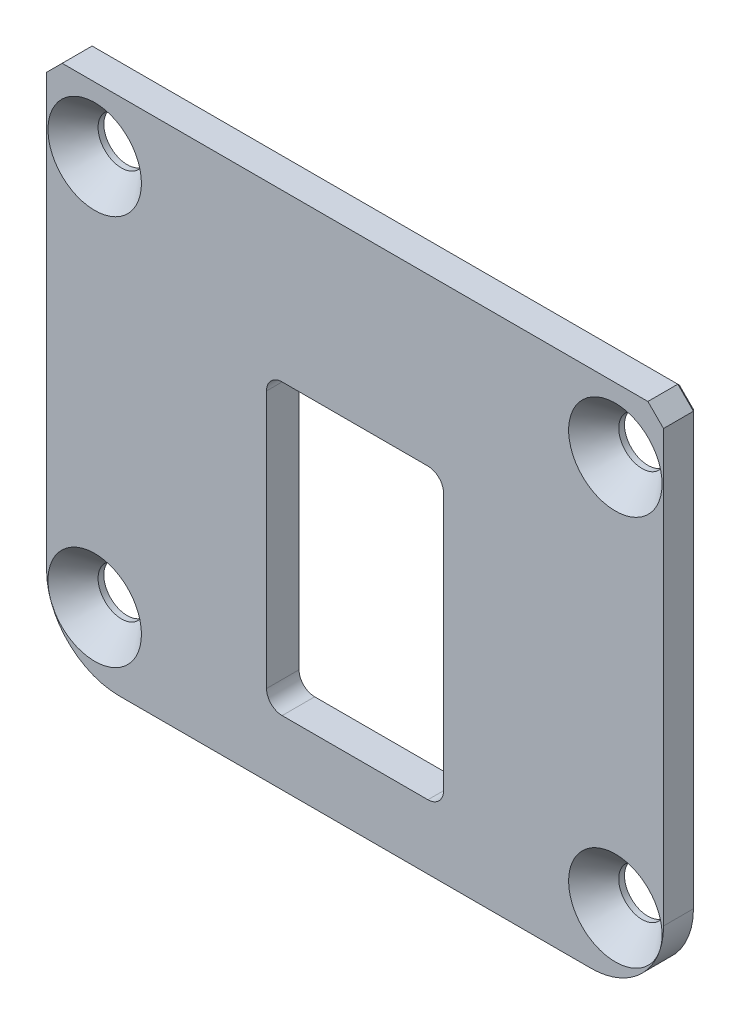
ISO-10303-21;
HEADER;
FILE_DESCRIPTION(('STEP AP214'),'2;1');
FILE_NAME('part.step','',(''),(''),'','','');
FILE_SCHEMA(('AUTOMOTIVE_DESIGN { 1 0 10303 214 1 1 1 1 }'));
ENDSEC;
DATA;
#1=APPLICATION_CONTEXT('core data for automotive mechanical design processes');
#2=APPLICATION_PROTOCOL_DEFINITION('international standard','automotive_design',2000,#1);
#3=PRODUCT_CONTEXT('',#1,'mechanical');
#4=PRODUCT('Part','Part','',(#3));
#5=PRODUCT_RELATED_PRODUCT_CATEGORY('part','',(#4));
#6=PRODUCT_DEFINITION_FORMATION('','',#4);
#7=PRODUCT_DEFINITION_CONTEXT('part definition',#1,'design');
#8=PRODUCT_DEFINITION('design','',#6,#7);
#9=PRODUCT_DEFINITION_SHAPE('','',#8);
#10=(LENGTH_UNIT() NAMED_UNIT(*) SI_UNIT(.MILLI.,.METRE.));
#11=(NAMED_UNIT(*) PLANE_ANGLE_UNIT() SI_UNIT($,.RADIAN.));
#12=(NAMED_UNIT(*) SI_UNIT($,.STERADIAN.) SOLID_ANGLE_UNIT());
#13=UNCERTAINTY_MEASURE_WITH_UNIT(LENGTH_MEASURE(1.E-05),#10,'distance_accuracy_value','');
#14=(GEOMETRIC_REPRESENTATION_CONTEXT(3) GLOBAL_UNCERTAINTY_ASSIGNED_CONTEXT((#13)) GLOBAL_UNIT_ASSIGNED_CONTEXT((#10,
#11,#12)) REPRESENTATION_CONTEXT('',''));
#15=CARTESIAN_POINT('',(0.,0.,0.));
#16=DIRECTION('',(0.,0.,1.));
#17=DIRECTION('',(1.,0.,0.));
#18=AXIS2_PLACEMENT_3D('',#15,#16,#17);
#19=CARTESIAN_POINT('',(-30.099,0.,-3.175));
#20=DIRECTION('',(-1.,0.,0.));
#21=DIRECTION('',(0.,-1.,0.));
#22=AXIS2_PLACEMENT_3D('',#19,#20,#21);
#23=PLANE('',#22);
#24=DIRECTION('',(0.,0.,-1.));
#25=VECTOR('',#24,1.);
#26=CARTESIAN_POINT('',(-30.099,-1.524,-3.175));
#27=LINE('',#26,#25);
#28=CARTESIAN_POINT('',(-30.099,-1.524,0.));
#29=VERTEX_POINT('',#28);
#30=CARTESIAN_POINT('',(-30.099,-1.524,-2.921));
#31=VERTEX_POINT('',#30);
#32=EDGE_CURVE('E296',#29,#31,#27,.T.);
#33=ORIENTED_EDGE('',*,*,#32,.T.);
#34=DIRECTION('',(0.,-1.,0.));
#35=VECTOR('',#34,1.);
#36=CARTESIAN_POINT('',(-30.099,-43.561,-2.921));
#37=LINE('',#36,#35);
#38=CARTESIAN_POINT('',(-30.099,-43.561,-2.921));
#39=VERTEX_POINT('',#38);
#40=EDGE_CURVE('E339',#31,#39,#37,.T.);
#41=ORIENTED_EDGE('',*,*,#40,.T.);
#42=DIRECTION('',(0.,0.,1.));
#43=VECTOR('',#42,1.);
#44=CARTESIAN_POINT('',(-30.099,-43.561,-3.175));
#45=LINE('',#44,#43);
#46=CARTESIAN_POINT('',(-30.099,-43.561,0.));
#47=VERTEX_POINT('',#46);
#48=EDGE_CURVE('E301',#39,#47,#45,.T.);
#49=ORIENTED_EDGE('',*,*,#48,.T.);
#50=DIRECTION('',(0.,-1.,0.));
#51=VECTOR('',#50,1.);
#52=CARTESIAN_POINT('',(-30.099,0.,0.));
#53=LINE('',#52,#51);
#54=EDGE_CURVE('E275',#29,#47,#53,.T.);
#55=ORIENTED_EDGE('',*,*,#54,.F.);
#56=EDGE_LOOP('',(#33,#41,#49,#55));
#57=FACE_BOUND('',#56,.T.);
#58=ADVANCED_FACE('F32',(#57),#23,.T.);
#59=CARTESIAN_POINT('',(-30.099,0.,-3.175));
#60=DIRECTION('',(0.,1.,0.));
#61=DIRECTION('',(0.,0.,1.));
#62=AXIS2_PLACEMENT_3D('',#59,#60,#61);
#63=PLANE('',#62);
#64=DIRECTION('',(0.,0.,-1.));
#65=VECTOR('',#64,1.);
#66=CARTESIAN_POINT('',(28.575,0.,-3.175));
#67=LINE('',#66,#65);
#68=CARTESIAN_POINT('',(28.575,0.,0.));
#69=VERTEX_POINT('',#68);
#70=CARTESIAN_POINT('',(28.575,0.,-2.921));
#71=VERTEX_POINT('',#70);
#72=EDGE_CURVE('E287',#69,#71,#67,.T.);
#73=ORIENTED_EDGE('',*,*,#72,.T.);
#74=DIRECTION('',(-1.,0.,0.));
#75=VECTOR('',#74,1.);
#76=CARTESIAN_POINT('',(-28.575,0.,-2.921));
#77=LINE('',#76,#75);
#78=CARTESIAN_POINT('',(-28.575,0.,-2.921));
#79=VERTEX_POINT('',#78);
#80=EDGE_CURVE('E335',#71,#79,#77,.T.);
#81=ORIENTED_EDGE('',*,*,#80,.T.);
#82=DIRECTION('',(0.,0.,1.));
#83=VECTOR('',#82,1.);
#84=CARTESIAN_POINT('',(-28.575,0.,-3.175));
#85=LINE('',#84,#83);
#86=CARTESIAN_POINT('',(-28.575,0.,0.));
#87=VERTEX_POINT('',#86);
#88=EDGE_CURVE('E290',#79,#87,#85,.T.);
#89=ORIENTED_EDGE('',*,*,#88,.T.);
#90=DIRECTION('',(-1.,0.,0.));
#91=VECTOR('',#90,1.);
#92=CARTESIAN_POINT('',(-30.099,0.,0.));
#93=LINE('',#92,#91);
#94=EDGE_CURVE('E284',#69,#87,#93,.T.);
#95=ORIENTED_EDGE('',*,*,#94,.F.);
#96=EDGE_LOOP('',(#73,#81,#89,#95));
#97=FACE_BOUND('',#96,.T.);
#98=ADVANCED_FACE('F429',(#97),#63,.T.);
#99=CARTESIAN_POINT('',(30.099,0.,-3.175));
#100=DIRECTION('',(1.,0.,0.));
#101=DIRECTION('',(0.,1.,0.));
#102=AXIS2_PLACEMENT_3D('',#99,#100,#101);
#103=PLANE('',#102);
#104=DIRECTION('',(0.,0.,1.));
#105=VECTOR('',#104,1.);
#106=CARTESIAN_POINT('',(30.099,-43.561,-3.175));
#107=LINE('',#106,#105);
#108=CARTESIAN_POINT('',(30.099,-43.561,0.));
#109=VERTEX_POINT('',#108);
#110=CARTESIAN_POINT('',(30.099,-43.561,-2.921));
#111=VERTEX_POINT('',#110);
#112=EDGE_CURVE('E312',#109,#111,#107,.F.);
#113=ORIENTED_EDGE('',*,*,#112,.T.);
#114=DIRECTION('',(0.,1.,0.));
#115=VECTOR('',#114,1.);
#116=CARTESIAN_POINT('',(30.099,-1.524,-2.921));
#117=LINE('',#116,#115);
#118=CARTESIAN_POINT('',(30.099,-1.524,-2.921));
#119=VERTEX_POINT('',#118);
#120=EDGE_CURVE('E341',#111,#119,#117,.T.);
#121=ORIENTED_EDGE('',*,*,#120,.T.);
#122=DIRECTION('',(0.,0.,1.));
#123=VECTOR('',#122,1.);
#124=CARTESIAN_POINT('',(30.099,-1.524,-3.175));
#125=LINE('',#124,#123);
#126=CARTESIAN_POINT('',(30.099,-1.524,0.));
#127=VERTEX_POINT('',#126);
#128=EDGE_CURVE('E299',#119,#127,#125,.T.);
#129=ORIENTED_EDGE('',*,*,#128,.T.);
#130=DIRECTION('',(0.,1.,0.));
#131=VECTOR('',#130,1.);
#132=CARTESIAN_POINT('',(30.099,0.,0.));
#133=LINE('',#132,#131);
#134=EDGE_CURVE('E281',#109,#127,#133,.T.);
#135=ORIENTED_EDGE('',*,*,#134,.F.);
#136=EDGE_LOOP('',(#113,#121,#129,#135));
#137=FACE_BOUND('',#136,.T.);
#138=ADVANCED_FACE('F420',(#137),#103,.T.);
#139=CARTESIAN_POINT('',(-30.099,-50.673,-3.175));
#140=DIRECTION('',(0.,-1.,0.));
#141=DIRECTION('',(0.,0.,-1.));
#142=AXIS2_PLACEMENT_3D('',#139,#140,#141);
#143=PLANE('',#142);
#144=DIRECTION('',(0.,0.,1.));
#145=VECTOR('',#144,1.);
#146=CARTESIAN_POINT('',(-22.987,-50.673,-3.175));
#147=LINE('',#146,#145);
#148=CARTESIAN_POINT('',(-22.987,-50.673,0.));
#149=VERTEX_POINT('',#148);
#150=CARTESIAN_POINT('',(-22.987,-50.673,-2.921));
#151=VERTEX_POINT('',#150);
#152=EDGE_CURVE('E309',#149,#151,#147,.F.);
#153=ORIENTED_EDGE('',*,*,#152,.T.);
#154=DIRECTION('',(1.,0.,0.));
#155=VECTOR('',#154,1.);
#156=CARTESIAN_POINT('',(22.987,-50.673,-2.921));
#157=LINE('',#156,#155);
#158=CARTESIAN_POINT('',(22.987,-50.673,-2.921));
#159=VERTEX_POINT('',#158);
#160=EDGE_CURVE('E11',#151,#159,#157,.T.);
#161=ORIENTED_EDGE('',*,*,#160,.T.);
#162=DIRECTION('',(0.,0.,1.));
#163=VECTOR('',#162,1.);
#164=CARTESIAN_POINT('',(22.987,-50.673,-3.175));
#165=LINE('',#164,#163);
#166=CARTESIAN_POINT('',(22.987,-50.673,0.));
#167=VERTEX_POINT('',#166);
#168=EDGE_CURVE('E307',#159,#167,#165,.T.);
#169=ORIENTED_EDGE('',*,*,#168,.T.);
#170=DIRECTION('',(1.,0.,0.));
#171=VECTOR('',#170,1.);
#172=CARTESIAN_POINT('',(-30.099,-50.673,0.));
#173=LINE('',#172,#171);
#174=EDGE_CURVE('E278',#149,#167,#173,.T.);
#175=ORIENTED_EDGE('',*,*,#174,.F.);
#176=EDGE_LOOP('',(#153,#161,#169,#175));
#177=FACE_BOUND('',#176,.T.);
#178=ADVANCED_FACE('F383',(#177),#143,.T.);
#179=CARTESIAN_POINT('',(0.,0.,-3.175));
#180=DIRECTION('',(0.,0.,1.));
#181=DIRECTION('',(1.,0.,0.));
#182=AXIS2_PLACEMENT_3D('',#179,#180,#181);
#183=PLANE('',#182);
#184=DIRECTION('',(0.,1.,0.));
#185=VECTOR('',#184,1.);
#186=CARTESIAN_POINT('',(8.636,-17.7165,-3.175));
#187=LINE('',#186,#185);
#188=CARTESIAN_POINT('',(8.636,-42.8625,-3.175));
#189=VERTEX_POINT('',#188);
#190=CARTESIAN_POINT('',(8.636,-17.7165,-3.175));
#191=VERTEX_POINT('',#190);
#192=EDGE_CURVE('E178',#189,#191,#187,.T.);
#193=ORIENTED_EDGE('',*,*,#192,.T.);
#194=CARTESIAN_POINT('',(7.112,-17.7165,-3.175));
#195=DIRECTION('',(0.,0.,1.));
#196=DIRECTION('',(-1.,0.,0.));
#197=AXIS2_PLACEMENT_3D('',#194,#195,#196);
#198=CIRCLE('',#197,1.524);
#199=CARTESIAN_POINT('',(7.112,-16.1925,-3.175));
#200=VERTEX_POINT('',#199);
#201=EDGE_CURVE('E172',#191,#200,#198,.T.);
#202=ORIENTED_EDGE('',*,*,#201,.T.);
#203=DIRECTION('',(-1.,0.,0.));
#204=VECTOR('',#203,1.);
#205=CARTESIAN_POINT('',(-7.11199999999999,-16.1925,-3.175));
#206=LINE('',#205,#204);
#207=CARTESIAN_POINT('',(-7.11199999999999,-16.1925,-3.175));
#208=VERTEX_POINT('',#207);
#209=EDGE_CURVE('E181',#200,#208,#206,.T.);
#210=ORIENTED_EDGE('',*,*,#209,.T.);
#211=CARTESIAN_POINT('',(-7.112,-17.7165,-3.175));
#212=DIRECTION('',(0.,0.,1.));
#213=DIRECTION('',(1.,0.,0.));
#214=AXIS2_PLACEMENT_3D('',#211,#212,#213);
#215=CIRCLE('',#214,1.524);
#216=CARTESIAN_POINT('',(-8.636,-17.7165,-3.175));
#217=VERTEX_POINT('',#216);
#218=EDGE_CURVE('E49',#208,#217,#215,.T.);
#219=ORIENTED_EDGE('',*,*,#218,.T.);
#220=DIRECTION('',(0.,-1.,0.));
#221=VECTOR('',#220,1.);
#222=CARTESIAN_POINT('',(-8.636,-17.7165,-3.175));
#223=LINE('',#222,#221);
#224=CARTESIAN_POINT('',(-8.63599999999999,-42.8625,-3.175));
#225=VERTEX_POINT('',#224);
#226=EDGE_CURVE('E196',#217,#225,#223,.T.);
#227=ORIENTED_EDGE('',*,*,#226,.T.);
#228=CARTESIAN_POINT('',(-7.11199999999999,-42.8625,-3.175));
#229=DIRECTION('',(0.,0.,1.));
#230=DIRECTION('',(1.,0.,0.));
#231=AXIS2_PLACEMENT_3D('',#228,#229,#230);
#232=CIRCLE('',#231,1.524);
#233=CARTESIAN_POINT('',(-7.11199999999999,-44.3865,-3.175));
#234=VERTEX_POINT('',#233);
#235=EDGE_CURVE('E199',#225,#234,#232,.T.);
#236=ORIENTED_EDGE('',*,*,#235,.T.);
#237=DIRECTION('',(1.,0.,0.));
#238=VECTOR('',#237,1.);
#239=CARTESIAN_POINT('',(-7.11199999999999,-44.3865,-3.175));
#240=LINE('',#239,#238);
#241=CARTESIAN_POINT('',(7.112,-44.3865,-3.175));
#242=VERTEX_POINT('',#241);
#243=EDGE_CURVE('E202',#234,#242,#240,.T.);
#244=ORIENTED_EDGE('',*,*,#243,.T.);
#245=CARTESIAN_POINT('',(7.112,-42.8625,-3.175));
#246=DIRECTION('',(0.,0.,1.));
#247=DIRECTION('',(1.,0.,0.));
#248=AXIS2_PLACEMENT_3D('',#245,#246,#247);
#249=CIRCLE('',#248,1.524);
#250=EDGE_CURVE('E205',#242,#189,#249,.T.);
#251=ORIENTED_EDGE('',*,*,#250,.T.);
#252=EDGE_LOOP('',(#193,#202,#210,#219,#227,#236,#244,#251));
#253=FACE_BOUND('',#252,.T.);
#254=DIRECTION('',(1.,0.,0.));
#255=VECTOR('',#254,1.);
#256=CARTESIAN_POINT('',(28.575,-0.253999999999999,-3.175));
#257=LINE('',#256,#255);
#258=CARTESIAN_POINT('',(-28.4697897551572,-0.253999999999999,-3.175));
#259=VERTEX_POINT('',#258);
#260=CARTESIAN_POINT('',(28.4697897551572,-0.253999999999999,-3.175));
#261=VERTEX_POINT('',#260);
#262=EDGE_CURVE('E327',#259,#261,#257,.T.);
#263=ORIENTED_EDGE('',*,*,#262,.T.);
#264=DIRECTION('',(0.707106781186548,-0.707106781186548,0.));
#265=VECTOR('',#264,1.);
#266=CARTESIAN_POINT('',(29.9193948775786,-1.70360512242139,-3.175));
#267=LINE('',#266,#265);
#268=CARTESIAN_POINT('',(29.845,-1.62921024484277,-3.175));
#269=VERTEX_POINT('',#268);
#270=EDGE_CURVE('E329',#261,#269,#267,.T.);
#271=ORIENTED_EDGE('',*,*,#270,.T.);
#272=DIRECTION('',(0.,-1.,0.));
#273=VECTOR('',#272,1.);
#274=CARTESIAN_POINT('',(29.845,-43.561,-3.175));
#275=LINE('',#274,#273);
#276=CARTESIAN_POINT('',(29.845,-43.561,-3.175));
#277=VERTEX_POINT('',#276);
#278=EDGE_CURVE('E321',#269,#277,#275,.T.);
#279=ORIENTED_EDGE('',*,*,#278,.T.);
#280=CARTESIAN_POINT('',(22.987,-43.561,-3.175));
#281=DIRECTION('',(0.,0.,1.));
#282=DIRECTION('',(1.,0.,0.));
#283=AXIS2_PLACEMENT_3D('',#280,#281,#282);
#284=CIRCLE('',#283,6.858);
#285=CARTESIAN_POINT('',(22.987,-50.419,-3.175));
#286=VERTEX_POINT('',#285);
#287=EDGE_CURVE('E317',#277,#286,#284,.F.);
#288=ORIENTED_EDGE('',*,*,#287,.T.);
#289=DIRECTION('',(-1.,0.,0.));
#290=VECTOR('',#289,1.);
#291=CARTESIAN_POINT('',(-22.987,-50.419,-3.175));
#292=LINE('',#291,#290);
#293=CARTESIAN_POINT('',(-22.987,-50.419,-3.175));
#294=VERTEX_POINT('',#293);
#295=EDGE_CURVE('E315',#286,#294,#292,.T.);
#296=ORIENTED_EDGE('',*,*,#295,.T.);
#297=CARTESIAN_POINT('',(-22.987,-43.561,-3.175));
#298=DIRECTION('',(0.,0.,1.));
#299=DIRECTION('',(1.,0.,0.));
#300=AXIS2_PLACEMENT_3D('',#297,#298,#299);
#301=CIRCLE('',#300,6.858);
#302=CARTESIAN_POINT('',(-29.845,-43.561,-3.175));
#303=VERTEX_POINT('',#302);
#304=EDGE_CURVE('E319',#294,#303,#301,.F.);
#305=ORIENTED_EDGE('',*,*,#304,.T.);
#306=DIRECTION('',(0.,1.,0.));
#307=VECTOR('',#306,1.);
#308=CARTESIAN_POINT('',(-29.845,-1.524,-3.175));
#309=LINE('',#308,#307);
#310=CARTESIAN_POINT('',(-29.845,-1.62921024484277,-3.175));
#311=VERTEX_POINT('',#310);
#312=EDGE_CURVE('E323',#303,#311,#309,.T.);
#313=ORIENTED_EDGE('',*,*,#312,.T.);
#314=DIRECTION('',(0.707106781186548,0.707106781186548,0.));
#315=VECTOR('',#314,1.);
#316=CARTESIAN_POINT('',(-28.3953948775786,-0.179605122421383,-3.175));
#317=LINE('',#316,#315);
#318=EDGE_CURVE('E325',#311,#259,#317,.T.);
#319=ORIENTED_EDGE('',*,*,#318,.T.);
#320=EDGE_LOOP('',(#263,#271,#279,#288,#296,#305,#313,#319));
#321=FACE_BOUND('',#320,.T.);
#322=CARTESIAN_POINT('',(-25.4,-6.2865,-3.175));
#323=DIRECTION('',(0.,0.,1.));
#324=DIRECTION('',(1.,0.,0.));
#325=AXIS2_PLACEMENT_3D('',#322,#323,#324);
#326=CIRCLE('',#325,2.286);
#327=CARTESIAN_POINT('',(-23.114,-6.2865,-3.175));
#328=VERTEX_POINT('',#327);
#329=EDGE_CURVE('E245',#328,#328,#326,.T.);
#330=ORIENTED_EDGE('',*,*,#329,.T.);
#331=EDGE_LOOP('',(#330));
#332=FACE_BOUND('',#331,.T.);
#333=CARTESIAN_POINT('',(-25.4,-44.3865,-3.175));
#334=DIRECTION('',(0.,0.,1.));
#335=DIRECTION('',(1.,0.,0.));
#336=AXIS2_PLACEMENT_3D('',#333,#334,#335);
#337=CIRCLE('',#336,2.286);
#338=CARTESIAN_POINT('',(-23.114,-44.3865,-3.175));
#339=VERTEX_POINT('',#338);
#340=EDGE_CURVE('E254',#339,#339,#337,.T.);
#341=ORIENTED_EDGE('',*,*,#340,.T.);
#342=EDGE_LOOP('',(#341));
#343=FACE_BOUND('',#342,.T.);
#344=CARTESIAN_POINT('',(25.4,-44.3865,-3.175));
#345=DIRECTION('',(0.,0.,1.));
#346=DIRECTION('',(1.,0.,0.));
#347=AXIS2_PLACEMENT_3D('',#344,#345,#346);
#348=CIRCLE('',#347,2.286);
#349=CARTESIAN_POINT('',(27.686,-44.3865,-3.175));
#350=VERTEX_POINT('',#349);
#351=EDGE_CURVE('E263',#350,#350,#348,.T.);
#352=ORIENTED_EDGE('',*,*,#351,.T.);
#353=EDGE_LOOP('',(#352));
#354=FACE_BOUND('',#353,.T.);
#355=CARTESIAN_POINT('',(25.4,-6.2865,-3.175));
#356=DIRECTION('',(0.,0.,1.));
#357=DIRECTION('',(1.,0.,0.));
#358=AXIS2_PLACEMENT_3D('',#355,#356,#357);
#359=CIRCLE('',#358,2.286);
#360=CARTESIAN_POINT('',(27.686,-6.2865,-3.175));
#361=VERTEX_POINT('',#360);
#362=EDGE_CURVE('E272',#361,#361,#359,.T.);
#363=ORIENTED_EDGE('',*,*,#362,.T.);
#364=EDGE_LOOP('',(#363));
#365=FACE_BOUND('',#364,.T.);
#366=ADVANCED_FACE('F185',(#253,#321,#332,#343,#354,#365),#183,.F.);
#367=CARTESIAN_POINT('',(0.,0.,0.));
#368=DIRECTION('',(0.,0.,1.));
#369=DIRECTION('',(1.,0.,0.));
#370=AXIS2_PLACEMENT_3D('',#367,#368,#369);
#371=PLANE('',#370);
#372=CARTESIAN_POINT('',(7.112,-17.7165,0.));
#373=DIRECTION('',(0.,0.,1.));
#374=DIRECTION('',(-1.,0.,0.));
#375=AXIS2_PLACEMENT_3D('',#372,#373,#374);
#376=CIRCLE('',#375,1.524);
#377=CARTESIAN_POINT('',(8.636,-17.7165,0.));
#378=VERTEX_POINT('',#377);
#379=CARTESIAN_POINT('',(7.112,-16.1925,0.));
#380=VERTEX_POINT('',#379);
#381=EDGE_CURVE('E57',#378,#380,#376,.T.);
#382=ORIENTED_EDGE('',*,*,#381,.F.);
#383=DIRECTION('',(0.,1.,0.));
#384=VECTOR('',#383,1.);
#385=CARTESIAN_POINT('',(8.636,-17.7165,0.));
#386=LINE('',#385,#384);
#387=CARTESIAN_POINT('',(8.636,-42.8625,0.));
#388=VERTEX_POINT('',#387);
#389=EDGE_CURVE('E189',#388,#378,#386,.T.);
#390=ORIENTED_EDGE('',*,*,#389,.F.);
#391=CARTESIAN_POINT('',(7.112,-42.8625,0.));
#392=DIRECTION('',(0.,0.,1.));
#393=DIRECTION('',(1.,0.,0.));
#394=AXIS2_PLACEMENT_3D('',#391,#392,#393);
#395=CIRCLE('',#394,1.524);
#396=CARTESIAN_POINT('',(7.112,-44.3865,0.));
#397=VERTEX_POINT('',#396);
#398=EDGE_CURVE('E192',#397,#388,#395,.T.);
#399=ORIENTED_EDGE('',*,*,#398,.F.);
#400=DIRECTION('',(1.,0.,0.));
#401=VECTOR('',#400,1.);
#402=CARTESIAN_POINT('',(-7.11199999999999,-44.3865,0.));
#403=LINE('',#402,#401);
#404=CARTESIAN_POINT('',(-7.11199999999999,-44.3865,0.));
#405=VERTEX_POINT('',#404);
#406=EDGE_CURVE('E220',#405,#397,#403,.T.);
#407=ORIENTED_EDGE('',*,*,#406,.F.);
#408=CARTESIAN_POINT('',(-7.11199999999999,-42.8625,0.));
#409=DIRECTION('',(0.,0.,1.));
#410=DIRECTION('',(1.,0.,0.));
#411=AXIS2_PLACEMENT_3D('',#408,#409,#410);
#412=CIRCLE('',#411,1.524);
#413=CARTESIAN_POINT('',(-8.63599999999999,-42.8625,0.));
#414=VERTEX_POINT('',#413);
#415=EDGE_CURVE('E217',#414,#405,#412,.T.);
#416=ORIENTED_EDGE('',*,*,#415,.F.);
#417=DIRECTION('',(0.,-1.,0.));
#418=VECTOR('',#417,1.);
#419=CARTESIAN_POINT('',(-8.636,-17.7165,0.));
#420=LINE('',#419,#418);
#421=CARTESIAN_POINT('',(-8.636,-17.7165,0.));
#422=VERTEX_POINT('',#421);
#423=EDGE_CURVE('E214',#422,#414,#420,.T.);
#424=ORIENTED_EDGE('',*,*,#423,.F.);
#425=CARTESIAN_POINT('',(-7.112,-17.7165,0.));
#426=DIRECTION('',(0.,0.,1.));
#427=DIRECTION('',(1.,0.,0.));
#428=AXIS2_PLACEMENT_3D('',#425,#426,#427);
#429=CIRCLE('',#428,1.524);
#430=CARTESIAN_POINT('',(-7.11199999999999,-16.1925,0.));
#431=VERTEX_POINT('',#430);
#432=EDGE_CURVE('E211',#431,#422,#429,.T.);
#433=ORIENTED_EDGE('',*,*,#432,.F.);
#434=DIRECTION('',(-1.,0.,0.));
#435=VECTOR('',#434,1.);
#436=CARTESIAN_POINT('',(-7.11199999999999,-16.1925,0.));
#437=LINE('',#436,#435);
#438=EDGE_CURVE('E209',#380,#431,#437,.T.);
#439=ORIENTED_EDGE('',*,*,#438,.F.);
#440=EDGE_LOOP('',(#382,#390,#399,#407,#416,#424,#433,#439));
#441=FACE_BOUND('',#440,.T.);
#442=CARTESIAN_POINT('',(-25.4,-6.2865,0.));
#443=DIRECTION('',(0.,0.,1.));
#444=DIRECTION('',(1.,0.,0.));
#445=AXIS2_PLACEMENT_3D('',#442,#443,#444);
#446=CIRCLE('',#445,4.5593);
#447=CARTESIAN_POINT('',(-20.8407,-6.2865,0.));
#448=VERTEX_POINT('',#447);
#449=EDGE_CURVE('E239',#448,#448,#446,.T.);
#450=ORIENTED_EDGE('',*,*,#449,.F.);
#451=EDGE_LOOP('',(#450));
#452=FACE_BOUND('',#451,.T.);
#453=CARTESIAN_POINT('',(-25.4,-44.3865,0.));
#454=DIRECTION('',(0.,0.,1.));
#455=DIRECTION('',(1.,0.,0.));
#456=AXIS2_PLACEMENT_3D('',#453,#454,#455);
#457=CIRCLE('',#456,4.5593);
#458=CARTESIAN_POINT('',(-20.8407,-44.3865,0.));
#459=VERTEX_POINT('',#458);
#460=EDGE_CURVE('E248',#459,#459,#457,.T.);
#461=ORIENTED_EDGE('',*,*,#460,.F.);
#462=EDGE_LOOP('',(#461));
#463=FACE_BOUND('',#462,.T.);
#464=CARTESIAN_POINT('',(25.4,-44.3865,0.));
#465=DIRECTION('',(0.,0.,1.));
#466=DIRECTION('',(1.,0.,0.));
#467=AXIS2_PLACEMENT_3D('',#464,#465,#466);
#468=CIRCLE('',#467,4.5593);
#469=CARTESIAN_POINT('',(29.9593,-44.3865,0.));
#470=VERTEX_POINT('',#469);
#471=EDGE_CURVE('E257',#470,#470,#468,.T.);
#472=ORIENTED_EDGE('',*,*,#471,.F.);
#473=EDGE_LOOP('',(#472));
#474=FACE_BOUND('',#473,.T.);
#475=CARTESIAN_POINT('',(25.4,-6.2865,0.));
#476=DIRECTION('',(0.,0.,1.));
#477=DIRECTION('',(1.,0.,0.));
#478=AXIS2_PLACEMENT_3D('',#475,#476,#477);
#479=CIRCLE('',#478,4.5593);
#480=CARTESIAN_POINT('',(29.9593,-6.2865,0.));
#481=VERTEX_POINT('',#480);
#482=EDGE_CURVE('E266',#481,#481,#479,.T.);
#483=ORIENTED_EDGE('',*,*,#482,.F.);
#484=EDGE_LOOP('',(#483));
#485=FACE_BOUND('',#484,.T.);
#486=ORIENTED_EDGE('',*,*,#54,.T.);
#487=CARTESIAN_POINT('',(-22.987,-43.561,0.));
#488=DIRECTION('',(0.,0.,1.));
#489=DIRECTION('',(1.,0.,0.));
#490=AXIS2_PLACEMENT_3D('',#487,#488,#489);
#491=CIRCLE('',#490,7.112);
#492=EDGE_CURVE('E305',#47,#149,#491,.T.);
#493=ORIENTED_EDGE('',*,*,#492,.T.);
#494=ORIENTED_EDGE('',*,*,#174,.T.);
#495=CARTESIAN_POINT('',(22.987,-43.561,0.));
#496=DIRECTION('',(0.,0.,1.));
#497=DIRECTION('',(1.,0.,0.));
#498=AXIS2_PLACEMENT_3D('',#495,#496,#497);
#499=CIRCLE('',#498,7.112);
#500=EDGE_CURVE('E303',#167,#109,#499,.T.);
#501=ORIENTED_EDGE('',*,*,#500,.T.);
#502=ORIENTED_EDGE('',*,*,#134,.T.);
#503=DIRECTION('',(0.707106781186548,-0.707106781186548,0.));
#504=VECTOR('',#503,1.);
#505=CARTESIAN_POINT('',(14.2875,14.2875,0.));
#506=LINE('',#505,#504);
#507=EDGE_CURVE('E292',#127,#69,#506,.F.);
#508=ORIENTED_EDGE('',*,*,#507,.T.);
#509=ORIENTED_EDGE('',*,*,#94,.T.);
#510=DIRECTION('',(0.707106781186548,0.707106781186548,0.));
#511=VECTOR('',#510,1.);
#512=CARTESIAN_POINT('',(-14.2875,14.2875,0.));
#513=LINE('',#512,#511);
#514=EDGE_CURVE('E294',#87,#29,#513,.F.);
#515=ORIENTED_EDGE('',*,*,#514,.T.);
#516=EDGE_LOOP('',(#486,#493,#494,#501,#502,#508,#509,#515));
#517=FACE_BOUND('',#516,.T.);
#518=ADVANCED_FACE('F387',(#441,#452,#463,#474,#485,#517),#371,.T.);
#519=CARTESIAN_POINT('',(-28.575,0.,-3.175));
#520=DIRECTION('',(0.707106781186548,-0.707106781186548,0.));
#521=DIRECTION('',(0.,0.,1.));
#522=AXIS2_PLACEMENT_3D('',#519,#520,#521);
#523=PLANE('',#522);
#524=ORIENTED_EDGE('',*,*,#88,.F.);
#525=DIRECTION('',(0.707106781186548,0.707106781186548,0.));
#526=VECTOR('',#525,1.);
#527=CARTESIAN_POINT('',(-30.099,-1.524,-2.921));
#528=LINE('',#527,#526);
#529=EDGE_CURVE('E337',#79,#31,#528,.F.);
#530=ORIENTED_EDGE('',*,*,#529,.T.);
#531=ORIENTED_EDGE('',*,*,#32,.F.);
#532=ORIENTED_EDGE('',*,*,#514,.F.);
#533=EDGE_LOOP('',(#524,#530,#531,#532));
#534=FACE_BOUND('',#533,.T.);
#535=ADVANCED_FACE('F395',(#534),#523,.F.);
#536=CARTESIAN_POINT('',(30.099,-1.524,-3.175));
#537=DIRECTION('',(-0.707106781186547,-0.707106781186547,0.));
#538=DIRECTION('',(0.,0.,1.));
#539=AXIS2_PLACEMENT_3D('',#536,#537,#538);
#540=PLANE('',#539);
#541=ORIENTED_EDGE('',*,*,#128,.F.);
#542=DIRECTION('',(0.707106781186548,-0.707106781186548,0.));
#543=VECTOR('',#542,1.);
#544=CARTESIAN_POINT('',(28.575,0.,-2.921));
#545=LINE('',#544,#543);
#546=EDGE_CURVE('E332',#119,#71,#545,.F.);
#547=ORIENTED_EDGE('',*,*,#546,.T.);
#548=ORIENTED_EDGE('',*,*,#72,.F.);
#549=ORIENTED_EDGE('',*,*,#507,.F.);
#550=EDGE_LOOP('',(#541,#547,#548,#549));
#551=FACE_BOUND('',#550,.T.);
#552=ADVANCED_FACE('F426',(#551),#540,.F.);
#553=CARTESIAN_POINT('',(-22.987,-43.561,-3.175));
#554=DIRECTION('',(0.,0.,1.));
#555=DIRECTION('',(1.,0.,0.));
#556=AXIS2_PLACEMENT_3D('',#553,#554,#555);
#557=CYLINDRICAL_SURFACE('',#556,7.112);
#558=ORIENTED_EDGE('',*,*,#48,.F.);
#559=CARTESIAN_POINT('',(-22.987,-43.561,-2.921));
#560=DIRECTION('',(0.,0.,1.));
#561=DIRECTION('',(1.,0.,0.));
#562=AXIS2_PLACEMENT_3D('',#559,#560,#561);
#563=CIRCLE('',#562,7.112);
#564=EDGE_CURVE('E343',#39,#151,#563,.T.);
#565=ORIENTED_EDGE('',*,*,#564,.T.);
#566=ORIENTED_EDGE('',*,*,#152,.F.);
#567=ORIENTED_EDGE('',*,*,#492,.F.);
#568=EDGE_LOOP('',(#558,#565,#566,#567));
#569=FACE_BOUND('',#568,.T.);
#570=ADVANCED_FACE('F379',(#569),#557,.T.);
#571=CARTESIAN_POINT('',(22.987,-43.561,-3.175));
#572=DIRECTION('',(0.,0.,1.));
#573=DIRECTION('',(1.,0.,0.));
#574=AXIS2_PLACEMENT_3D('',#571,#572,#573);
#575=CYLINDRICAL_SURFACE('',#574,7.112);
#576=ORIENTED_EDGE('',*,*,#168,.F.);
#577=CARTESIAN_POINT('',(22.987,-43.561,-2.921));
#578=DIRECTION('',(0.,0.,1.));
#579=DIRECTION('',(1.,0.,0.));
#580=AXIS2_PLACEMENT_3D('',#577,#578,#579);
#581=CIRCLE('',#580,7.112);
#582=EDGE_CURVE('E41',#159,#111,#581,.T.);
#583=ORIENTED_EDGE('',*,*,#582,.T.);
#584=ORIENTED_EDGE('',*,*,#112,.F.);
#585=ORIENTED_EDGE('',*,*,#500,.F.);
#586=EDGE_LOOP('',(#576,#583,#584,#585));
#587=FACE_BOUND('',#586,.T.);
#588=ADVANCED_FACE('F418',(#587),#575,.T.);
#589=CARTESIAN_POINT('',(25.4,-6.2865,0.));
#590=DIRECTION('',(0.,0.,1.));
#591=DIRECTION('',(1.,0.,0.));
#592=AXIS2_PLACEMENT_3D('',#589,#590,#591);
#593=CYLINDRICAL_SURFACE('',#592,2.286);
#594=ORIENTED_EDGE('',*,*,#362,.F.);
#595=EDGE_LOOP('',(#594));
#596=FACE_BOUND('',#595,.T.);
#597=CARTESIAN_POINT('',(25.4,-6.2865,-2.61513250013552));
#598=DIRECTION('',(0.,0.,1.));
#599=DIRECTION('',(1.,0.,0.));
#600=AXIS2_PLACEMENT_3D('',#597,#598,#599);
#601=CIRCLE('',#600,2.286);
#602=CARTESIAN_POINT('',(27.686,-6.2865,-2.61513250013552));
#603=VERTEX_POINT('',#602);
#604=EDGE_CURVE('E269',#603,#603,#601,.T.);
#605=ORIENTED_EDGE('',*,*,#604,.T.);
#606=EDGE_LOOP('',(#605));
#607=FACE_BOUND('',#606,.T.);
#608=ADVANCED_FACE('F451',(#596,#607),#593,.F.);
#609=CARTESIAN_POINT('',(25.4,-6.2865,0.));
#610=DIRECTION('',(0.,0.,1.));
#611=DIRECTION('',(1.,0.,0.));
#612=AXIS2_PLACEMENT_3D('',#609,#610,#611);
#613=CONICAL_SURFACE('',#612,4.5593,0.715584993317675);
#614=ORIENTED_EDGE('',*,*,#604,.F.);
#615=EDGE_LOOP('',(#614));
#616=FACE_BOUND('',#615,.T.);
#617=ORIENTED_EDGE('',*,*,#482,.T.);
#618=EDGE_LOOP('',(#617));
#619=FACE_BOUND('',#618,.T.);
#620=ADVANCED_FACE('F503',(#616,#619),#613,.F.);
#621=CARTESIAN_POINT('',(25.4,-44.3865,0.));
#622=DIRECTION('',(0.,0.,1.));
#623=DIRECTION('',(1.,0.,0.));
#624=AXIS2_PLACEMENT_3D('',#621,#622,#623);
#625=CYLINDRICAL_SURFACE('',#624,2.286);
#626=ORIENTED_EDGE('',*,*,#351,.F.);
#627=EDGE_LOOP('',(#626));
#628=FACE_BOUND('',#627,.T.);
#629=CARTESIAN_POINT('',(25.4,-44.3865,-2.61513250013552));
#630=DIRECTION('',(0.,0.,1.));
#631=DIRECTION('',(1.,0.,0.));
#632=AXIS2_PLACEMENT_3D('',#629,#630,#631);
#633=CIRCLE('',#632,2.286);
#634=CARTESIAN_POINT('',(27.686,-44.3865,-2.61513250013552));
#635=VERTEX_POINT('',#634);
#636=EDGE_CURVE('E260',#635,#635,#633,.T.);
#637=ORIENTED_EDGE('',*,*,#636,.T.);
#638=EDGE_LOOP('',(#637));
#639=FACE_BOUND('',#638,.T.);
#640=ADVANCED_FACE('F499',(#628,#639),#625,.F.);
#641=CARTESIAN_POINT('',(25.4,-44.3865,0.));
#642=DIRECTION('',(0.,0.,1.));
#643=DIRECTION('',(1.,0.,0.));
#644=AXIS2_PLACEMENT_3D('',#641,#642,#643);
#645=CONICAL_SURFACE('',#644,4.5593,0.715584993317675);
#646=ORIENTED_EDGE('',*,*,#636,.F.);
#647=EDGE_LOOP('',(#646));
#648=FACE_BOUND('',#647,.T.);
#649=ORIENTED_EDGE('',*,*,#471,.T.);
#650=EDGE_LOOP('',(#649));
#651=FACE_BOUND('',#650,.T.);
#652=ADVANCED_FACE('F495',(#648,#651),#645,.F.);
#653=CARTESIAN_POINT('',(-25.4,-44.3865,0.));
#654=DIRECTION('',(0.,0.,1.));
#655=DIRECTION('',(1.,0.,0.));
#656=AXIS2_PLACEMENT_3D('',#653,#654,#655);
#657=CYLINDRICAL_SURFACE('',#656,2.286);
#658=ORIENTED_EDGE('',*,*,#340,.F.);
#659=EDGE_LOOP('',(#658));
#660=FACE_BOUND('',#659,.T.);
#661=CARTESIAN_POINT('',(-25.4,-44.3865,-2.61513250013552));
#662=DIRECTION('',(0.,0.,1.));
#663=DIRECTION('',(1.,0.,0.));
#664=AXIS2_PLACEMENT_3D('',#661,#662,#663);
#665=CIRCLE('',#664,2.286);
#666=CARTESIAN_POINT('',(-23.114,-44.3865,-2.61513250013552));
#667=VERTEX_POINT('',#666);
#668=EDGE_CURVE('E251',#667,#667,#665,.T.);
#669=ORIENTED_EDGE('',*,*,#668,.T.);
#670=EDGE_LOOP('',(#669));
#671=FACE_BOUND('',#670,.T.);
#672=ADVANCED_FACE('F491',(#660,#671),#657,.F.);
#673=CARTESIAN_POINT('',(-25.4,-44.3865,0.));
#674=DIRECTION('',(0.,0.,1.));
#675=DIRECTION('',(1.,0.,0.));
#676=AXIS2_PLACEMENT_3D('',#673,#674,#675);
#677=CONICAL_SURFACE('',#676,4.5593,0.715584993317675);
#678=ORIENTED_EDGE('',*,*,#668,.F.);
#679=EDGE_LOOP('',(#678));
#680=FACE_BOUND('',#679,.T.);
#681=ORIENTED_EDGE('',*,*,#460,.T.);
#682=EDGE_LOOP('',(#681));
#683=FACE_BOUND('',#682,.T.);
#684=ADVANCED_FACE('F481',(#680,#683),#677,.F.);
#685=CARTESIAN_POINT('',(-25.4,-6.2865,0.));
#686=DIRECTION('',(0.,0.,1.));
#687=DIRECTION('',(1.,0.,0.));
#688=AXIS2_PLACEMENT_3D('',#685,#686,#687);
#689=CYLINDRICAL_SURFACE('',#688,2.286);
#690=ORIENTED_EDGE('',*,*,#329,.F.);
#691=EDGE_LOOP('',(#690));
#692=FACE_BOUND('',#691,.T.);
#693=CARTESIAN_POINT('',(-25.4,-6.2865,-2.61513250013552));
#694=DIRECTION('',(0.,0.,1.));
#695=DIRECTION('',(1.,0.,0.));
#696=AXIS2_PLACEMENT_3D('',#693,#694,#695);
#697=CIRCLE('',#696,2.286);
#698=CARTESIAN_POINT('',(-23.114,-6.2865,-2.61513250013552));
#699=VERTEX_POINT('',#698);
#700=EDGE_CURVE('E242',#699,#699,#697,.T.);
#701=ORIENTED_EDGE('',*,*,#700,.T.);
#702=EDGE_LOOP('',(#701));
#703=FACE_BOUND('',#702,.T.);
#704=ADVANCED_FACE('F475',(#692,#703),#689,.F.);
#705=CARTESIAN_POINT('',(-25.4,-6.2865,0.));
#706=DIRECTION('',(0.,0.,1.));
#707=DIRECTION('',(1.,0.,0.));
#708=AXIS2_PLACEMENT_3D('',#705,#706,#707);
#709=CONICAL_SURFACE('',#708,4.5593,0.715584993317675);
#710=ORIENTED_EDGE('',*,*,#700,.F.);
#711=EDGE_LOOP('',(#710));
#712=FACE_BOUND('',#711,.T.);
#713=ORIENTED_EDGE('',*,*,#449,.T.);
#714=EDGE_LOOP('',(#713));
#715=FACE_BOUND('',#714,.T.);
#716=ADVANCED_FACE('F471',(#712,#715),#709,.F.);
#717=CARTESIAN_POINT('',(-22.987,-43.561,-3.175));
#718=DIRECTION('',(0.,0.,1.));
#719=DIRECTION('',(1.,0.,0.));
#720=AXIS2_PLACEMENT_3D('',#717,#718,#719);
#721=CONICAL_SURFACE('',#720,6.858,0.785398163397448);
#722=DIRECTION('',(0.,0.707106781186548,-0.707106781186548));
#723=VECTOR('',#722,1.);
#724=CARTESIAN_POINT('',(-22.987,-50.673,-2.921));
#725=LINE('',#724,#723);
#726=EDGE_CURVE('E360',#151,#294,#725,.T.);
#727=ORIENTED_EDGE('',*,*,#726,.F.);
#728=ORIENTED_EDGE('',*,*,#564,.F.);
#729=DIRECTION('',(-0.707106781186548,0.,0.707106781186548));
#730=VECTOR('',#729,1.);
#731=CARTESIAN_POINT('',(-29.845,-43.561,-3.175));
#732=LINE('',#731,#730);
#733=EDGE_CURVE('E36',#303,#39,#732,.T.);
#734=ORIENTED_EDGE('',*,*,#733,.F.);
#735=ORIENTED_EDGE('',*,*,#304,.F.);
#736=EDGE_LOOP('',(#727,#728,#734,#735));
#737=FACE_BOUND('',#736,.T.);
#738=ADVANCED_FACE('F34',(#737),#721,.T.);
#739=CARTESIAN_POINT('',(-30.099,0.,-2.921));
#740=DIRECTION('',(-0.707106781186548,0.,-0.707106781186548));
#741=DIRECTION('',(0.,1.,0.));
#742=AXIS2_PLACEMENT_3D('',#739,#740,#741);
#743=PLANE('',#742);
#744=ORIENTED_EDGE('',*,*,#733,.T.);
#745=ORIENTED_EDGE('',*,*,#40,.F.);
#746=DIRECTION('',(-0.678598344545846,0.281084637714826,0.678598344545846));
#747=VECTOR('',#746,1.);
#748=CARTESIAN_POINT('',(-30.3896932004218,-1.40359093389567,-2.63030679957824));
#749=LINE('',#748,#747);
#750=EDGE_CURVE('E358',#311,#31,#749,.T.);
#751=ORIENTED_EDGE('',*,*,#750,.F.);
#752=ORIENTED_EDGE('',*,*,#312,.F.);
#753=EDGE_LOOP('',(#744,#745,#751,#752));
#754=FACE_BOUND('',#753,.T.);
#755=ADVANCED_FACE('F371',(#754),#743,.T.);
#756=CARTESIAN_POINT('',(-30.099,-50.673,-2.921));
#757=DIRECTION('',(0.,-0.707106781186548,-0.707106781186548));
#758=DIRECTION('',(-1.,0.,0.));
#759=AXIS2_PLACEMENT_3D('',#756,#757,#758);
#760=PLANE('',#759);
#761=ORIENTED_EDGE('',*,*,#726,.T.);
#762=ORIENTED_EDGE('',*,*,#295,.F.);
#763=DIRECTION('',(0.,0.707106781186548,-0.707106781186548));
#764=VECTOR('',#763,1.);
#765=CARTESIAN_POINT('',(22.987,-50.673,-2.921));
#766=LINE('',#765,#764);
#767=EDGE_CURVE('E355',#159,#286,#766,.T.);
#768=ORIENTED_EDGE('',*,*,#767,.F.);
#769=ORIENTED_EDGE('',*,*,#160,.F.);
#770=EDGE_LOOP('',(#761,#762,#768,#769));
#771=FACE_BOUND('',#770,.T.);
#772=ADVANCED_FACE('F410',(#771),#760,.T.);
#773=CARTESIAN_POINT('',(-14.1078948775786,14.1078948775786,-3.175));
#774=DIRECTION('',(0.499999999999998,-0.499999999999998,0.70710678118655));
#775=DIRECTION('',(0.707106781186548,0.707106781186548,0.));
#776=AXIS2_PLACEMENT_3D('',#773,#774,#775);
#777=PLANE('',#776);
#778=ORIENTED_EDGE('',*,*,#750,.T.);
#779=ORIENTED_EDGE('',*,*,#529,.F.);
#780=DIRECTION('',(-0.281084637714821,0.678598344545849,0.678598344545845));
#781=VECTOR('',#780,1.);
#782=CARTESIAN_POINT('',(-30.0745160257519,3.6201519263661,0.699151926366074));
#783=LINE('',#782,#781);
#784=EDGE_CURVE('E352',#259,#79,#783,.T.);
#785=ORIENTED_EDGE('',*,*,#784,.F.);
#786=ORIENTED_EDGE('',*,*,#318,.F.);
#787=EDGE_LOOP('',(#778,#779,#785,#786));
#788=FACE_BOUND('',#787,.T.);
#789=ADVANCED_FACE('F399',(#788),#777,.F.);
#790=CARTESIAN_POINT('',(22.987,-43.561,-3.175));
#791=DIRECTION('',(0.,0.,1.));
#792=DIRECTION('',(1.,0.,0.));
#793=AXIS2_PLACEMENT_3D('',#790,#791,#792);
#794=CONICAL_SURFACE('',#793,6.858,0.785398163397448);
#795=ORIENTED_EDGE('',*,*,#767,.T.);
#796=ORIENTED_EDGE('',*,*,#287,.F.);
#797=DIRECTION('',(-0.707106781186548,0.,-0.707106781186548));
#798=VECTOR('',#797,1.);
#799=CARTESIAN_POINT('',(30.099,-43.561,-2.921));
#800=LINE('',#799,#798);
#801=EDGE_CURVE('E349',#111,#277,#800,.T.);
#802=ORIENTED_EDGE('',*,*,#801,.F.);
#803=ORIENTED_EDGE('',*,*,#582,.F.);
#804=EDGE_LOOP('',(#795,#796,#802,#803));
#805=FACE_BOUND('',#804,.T.);
#806=ADVANCED_FACE('F413',(#805),#794,.T.);
#807=CARTESIAN_POINT('',(-30.099,0.,-2.921));
#808=DIRECTION('',(0.,0.707106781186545,-0.70710678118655));
#809=DIRECTION('',(1.,0.,0.));
#810=AXIS2_PLACEMENT_3D('',#807,#808,#809);
#811=PLANE('',#810);
#812=ORIENTED_EDGE('',*,*,#784,.T.);
#813=ORIENTED_EDGE('',*,*,#80,.F.);
#814=DIRECTION('',(0.281084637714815,0.67859834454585,0.678598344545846));
#815=VECTOR('',#814,1.);
#816=CARTESIAN_POINT('',(23.9392509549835,-11.1916882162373,-14.1126882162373));
#817=LINE('',#816,#815);
#818=EDGE_CURVE('E347',#261,#71,#817,.T.);
#819=ORIENTED_EDGE('',*,*,#818,.F.);
#820=ORIENTED_EDGE('',*,*,#262,.F.);
#821=EDGE_LOOP('',(#812,#813,#819,#820));
#822=FACE_BOUND('',#821,.T.);
#823=ADVANCED_FACE('F404',(#822),#811,.T.);
#824=CARTESIAN_POINT('',(30.099,0.,-2.921));
#825=DIRECTION('',(0.707106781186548,0.,-0.707106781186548));
#826=DIRECTION('',(0.,-1.,0.));
#827=AXIS2_PLACEMENT_3D('',#824,#825,#826);
#828=PLANE('',#827);
#829=ORIENTED_EDGE('',*,*,#801,.T.);
#830=ORIENTED_EDGE('',*,*,#278,.F.);
#831=DIRECTION('',(-0.678598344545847,-0.28108463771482,-0.678598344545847));
#832=VECTOR('',#831,1.);
#833=CARTESIAN_POINT('',(30.3896932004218,-1.40359093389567,-2.63030679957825));
#834=LINE('',#833,#832);
#835=EDGE_CURVE('E227',#119,#269,#834,.T.);
#836=ORIENTED_EDGE('',*,*,#835,.F.);
#837=ORIENTED_EDGE('',*,*,#120,.F.);
#838=EDGE_LOOP('',(#829,#830,#836,#837));
#839=FACE_BOUND('',#838,.T.);
#840=ADVANCED_FACE('F455',(#839),#828,.T.);
#841=CARTESIAN_POINT('',(14.1078948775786,14.1078948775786,-3.175));
#842=DIRECTION('',(-0.5,-0.5,0.707106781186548));
#843=DIRECTION('',(0.707106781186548,-0.707106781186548,0.));
#844=AXIS2_PLACEMENT_3D('',#841,#842,#843);
#845=PLANE('',#844);
#846=ORIENTED_EDGE('',*,*,#818,.T.);
#847=ORIENTED_EDGE('',*,*,#546,.F.);
#848=ORIENTED_EDGE('',*,*,#835,.T.);
#849=ORIENTED_EDGE('',*,*,#270,.F.);
#850=EDGE_LOOP('',(#846,#847,#848,#849));
#851=FACE_BOUND('',#850,.T.);
#852=ADVANCED_FACE('F452',(#851),#845,.F.);
#853=CARTESIAN_POINT('',(7.112,-17.7165,-3.175));
#854=DIRECTION('',(0.,0.,1.));
#855=DIRECTION('',(1.,0.,0.));
#856=AXIS2_PLACEMENT_3D('',#853,#854,#855);
#857=CYLINDRICAL_SURFACE('',#856,1.524);
#858=ORIENTED_EDGE('',*,*,#381,.T.);
#859=DIRECTION('',(0.,0.,1.));
#860=VECTOR('',#859,1.);
#861=CARTESIAN_POINT('',(7.112,-16.1925,-3.175));
#862=LINE('',#861,#860);
#863=EDGE_CURVE('E168',#200,#380,#862,.T.);
#864=ORIENTED_EDGE('',*,*,#863,.F.);
#865=ORIENTED_EDGE('',*,*,#201,.F.);
#866=DIRECTION('',(0.,0.,1.));
#867=VECTOR('',#866,1.);
#868=CARTESIAN_POINT('',(8.636,-17.7165,-3.175));
#869=LINE('',#868,#867);
#870=EDGE_CURVE('E225',#191,#378,#869,.T.);
#871=ORIENTED_EDGE('',*,*,#870,.T.);
#872=EDGE_LOOP('',(#858,#864,#865,#871));
#873=FACE_BOUND('',#872,.T.);
#874=ADVANCED_FACE('F170',(#873),#857,.F.);
#875=CARTESIAN_POINT('',(8.636,-17.7165,-3.175));
#876=DIRECTION('',(1.,0.,0.));
#877=DIRECTION('',(0.,1.,0.));
#878=AXIS2_PLACEMENT_3D('',#875,#876,#877);
#879=PLANE('',#878);
#880=ORIENTED_EDGE('',*,*,#389,.T.);
#881=ORIENTED_EDGE('',*,*,#870,.F.);
#882=ORIENTED_EDGE('',*,*,#192,.F.);
#883=DIRECTION('',(0.,0.,1.));
#884=VECTOR('',#883,1.);
#885=CARTESIAN_POINT('',(8.636,-42.8625,-3.175));
#886=LINE('',#885,#884);
#887=EDGE_CURVE('E228',#189,#388,#886,.T.);
#888=ORIENTED_EDGE('',*,*,#887,.T.);
#889=EDGE_LOOP('',(#880,#881,#882,#888));
#890=FACE_BOUND('',#889,.T.);
#891=ADVANCED_FACE('F548',(#890),#879,.F.);
#892=CARTESIAN_POINT('',(7.112,-42.8625,-3.175));
#893=DIRECTION('',(0.,0.,1.));
#894=DIRECTION('',(1.,0.,0.));
#895=AXIS2_PLACEMENT_3D('',#892,#893,#894);
#896=CYLINDRICAL_SURFACE('',#895,1.524);
#897=ORIENTED_EDGE('',*,*,#398,.T.);
#898=ORIENTED_EDGE('',*,*,#887,.F.);
#899=ORIENTED_EDGE('',*,*,#250,.F.);
#900=DIRECTION('',(0.,0.,1.));
#901=VECTOR('',#900,1.);
#902=CARTESIAN_POINT('',(7.112,-44.3865,-3.175));
#903=LINE('',#902,#901);
#904=EDGE_CURVE('E230',#242,#397,#903,.T.);
#905=ORIENTED_EDGE('',*,*,#904,.T.);
#906=EDGE_LOOP('',(#897,#898,#899,#905));
#907=FACE_BOUND('',#906,.T.);
#908=ADVANCED_FACE('F546',(#907),#896,.F.);
#909=CARTESIAN_POINT('',(-7.11199999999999,-44.3865,-3.175));
#910=DIRECTION('',(0.,-1.,0.));
#911=DIRECTION('',(0.,0.,-1.));
#912=AXIS2_PLACEMENT_3D('',#909,#910,#911);
#913=PLANE('',#912);
#914=ORIENTED_EDGE('',*,*,#406,.T.);
#915=ORIENTED_EDGE('',*,*,#904,.F.);
#916=ORIENTED_EDGE('',*,*,#243,.F.);
#917=DIRECTION('',(0.,0.,1.));
#918=VECTOR('',#917,1.);
#919=CARTESIAN_POINT('',(-7.11199999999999,-44.3865,-3.175));
#920=LINE('',#919,#918);
#921=EDGE_CURVE('E232',#234,#405,#920,.T.);
#922=ORIENTED_EDGE('',*,*,#921,.T.);
#923=EDGE_LOOP('',(#914,#915,#916,#922));
#924=FACE_BOUND('',#923,.T.);
#925=ADVANCED_FACE('F543',(#924),#913,.F.);
#926=CARTESIAN_POINT('',(-7.11199999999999,-42.8625,-3.175));
#927=DIRECTION('',(0.,0.,1.));
#928=DIRECTION('',(1.,0.,0.));
#929=AXIS2_PLACEMENT_3D('',#926,#927,#928);
#930=CYLINDRICAL_SURFACE('',#929,1.524);
#931=ORIENTED_EDGE('',*,*,#415,.T.);
#932=ORIENTED_EDGE('',*,*,#921,.F.);
#933=ORIENTED_EDGE('',*,*,#235,.F.);
#934=DIRECTION('',(0.,0.,1.));
#935=VECTOR('',#934,1.);
#936=CARTESIAN_POINT('',(-8.63599999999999,-42.8625,-3.175));
#937=LINE('',#936,#935);
#938=EDGE_CURVE('E234',#225,#414,#937,.T.);
#939=ORIENTED_EDGE('',*,*,#938,.T.);
#940=EDGE_LOOP('',(#931,#932,#933,#939));
#941=FACE_BOUND('',#940,.T.);
#942=ADVANCED_FACE('F540',(#941),#930,.F.);
#943=CARTESIAN_POINT('',(-8.636,-17.7165,-3.175));
#944=DIRECTION('',(-1.,0.,0.));
#945=DIRECTION('',(0.,-1.,0.));
#946=AXIS2_PLACEMENT_3D('',#943,#944,#945);
#947=PLANE('',#946);
#948=ORIENTED_EDGE('',*,*,#423,.T.);
#949=ORIENTED_EDGE('',*,*,#938,.F.);
#950=ORIENTED_EDGE('',*,*,#226,.F.);
#951=DIRECTION('',(0.,0.,1.));
#952=VECTOR('',#951,1.);
#953=CARTESIAN_POINT('',(-8.636,-17.7165,-3.175));
#954=LINE('',#953,#952);
#955=EDGE_CURVE('E236',#217,#422,#954,.T.);
#956=ORIENTED_EDGE('',*,*,#955,.T.);
#957=EDGE_LOOP('',(#948,#949,#950,#956));
#958=FACE_BOUND('',#957,.T.);
#959=ADVANCED_FACE('F536',(#958),#947,.F.);
#960=CARTESIAN_POINT('',(-7.112,-17.7165,-3.175));
#961=DIRECTION('',(0.,0.,1.));
#962=DIRECTION('',(1.,0.,0.));
#963=AXIS2_PLACEMENT_3D('',#960,#961,#962);
#964=CYLINDRICAL_SURFACE('',#963,1.524);
#965=ORIENTED_EDGE('',*,*,#432,.T.);
#966=ORIENTED_EDGE('',*,*,#955,.F.);
#967=ORIENTED_EDGE('',*,*,#218,.F.);
#968=DIRECTION('',(0.,0.,1.));
#969=VECTOR('',#968,1.);
#970=CARTESIAN_POINT('',(-7.11199999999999,-16.1925,-3.175));
#971=LINE('',#970,#969);
#972=EDGE_CURVE('E177',#208,#431,#971,.T.);
#973=ORIENTED_EDGE('',*,*,#972,.T.);
#974=EDGE_LOOP('',(#965,#966,#967,#973));
#975=FACE_BOUND('',#974,.T.);
#976=ADVANCED_FACE('F533',(#975),#964,.F.);
#977=CARTESIAN_POINT('',(-7.11199999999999,-16.1925,-3.175));
#978=DIRECTION('',(0.,1.,0.));
#979=DIRECTION('',(0.,0.,1.));
#980=AXIS2_PLACEMENT_3D('',#977,#978,#979);
#981=PLANE('',#980);
#982=ORIENTED_EDGE('',*,*,#438,.T.);
#983=ORIENTED_EDGE('',*,*,#972,.F.);
#984=ORIENTED_EDGE('',*,*,#209,.F.);
#985=ORIENTED_EDGE('',*,*,#863,.T.);
#986=EDGE_LOOP('',(#982,#983,#984,#985));
#987=FACE_BOUND('',#986,.T.);
#988=ADVANCED_FACE('F182',(#987),#981,.F.);
#989=CLOSED_SHELL('',(#58,#98,#138,#178,#366,#518,#535,#552,#570,#588,#608,#620,#640,#652,#672,
#684,#704,#716,#738,#755,#772,#789,#806,#823,#840,#852,#874,#891,#908,#925,#942,#959,#976,#988));
#990=MANIFOLD_SOLID_BREP('B2',#989);
#991=ADVANCED_BREP_SHAPE_REPRESENTATION('',(#18,#990),#14);
#992=SHAPE_DEFINITION_REPRESENTATION(#9,#991);
ENDSEC;
END-ISO-10303-21;
